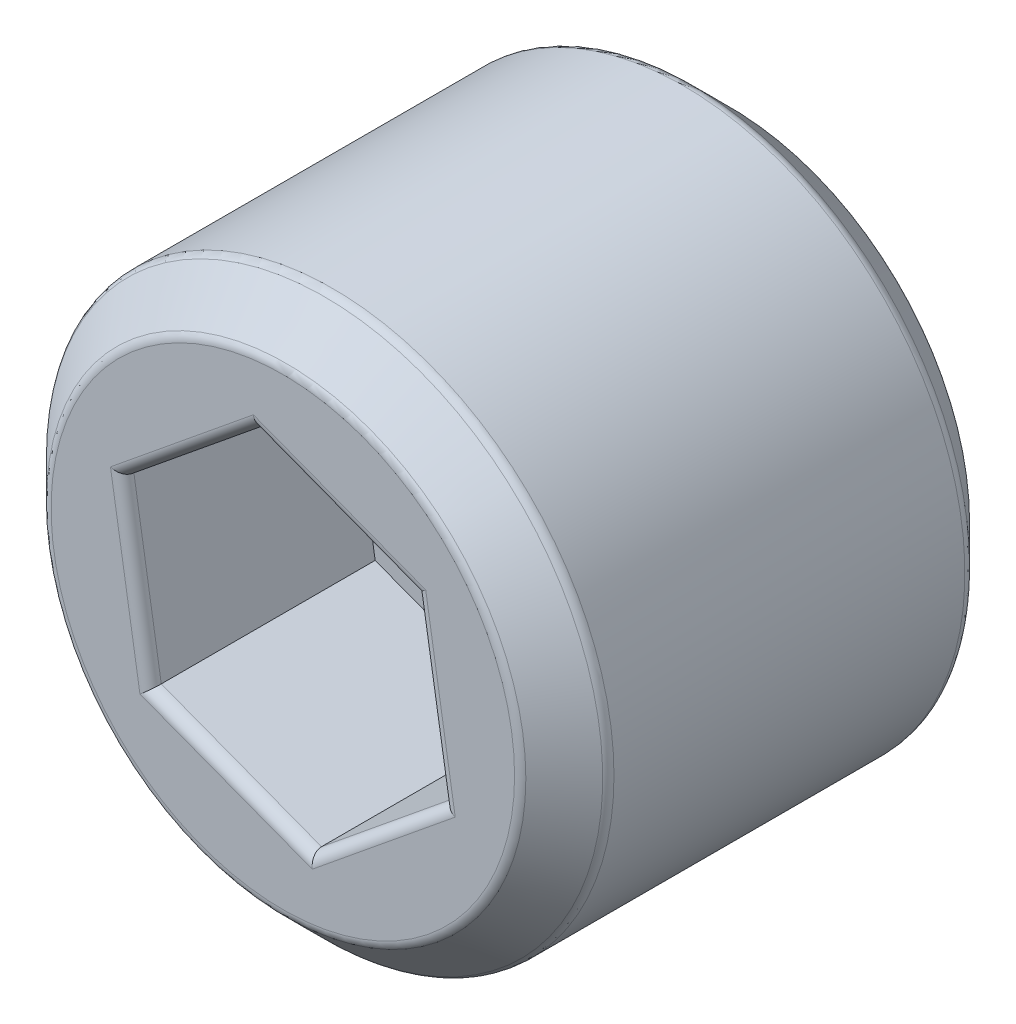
from build123d import *

# Parameters (mm, degrees)
ESQUISSE1_R             = 2.5
EXTRUSION1_DEPTH        = 4
CHANFREIN1_SIZE         = 0.4
ENL_V_MAT_EXTRU_1_DEPTH = 2
CONG_1_R                = 0.1


with BuildPart() as part:
    # Esquisse1 → Extrusion1 (new body)
    with BuildSketch(Plane.XY):
        with Locations(Location((0, 0, 0), (0, 0, 180))):
            Circle(ESQUISSE1_R)
    extrude(amount=EXTRUSION1_DEPTH)

    # Chanfrein1
    chanfrein1_edges = [part.edges().sort_by_distance(p)[0] for p in [
        (2.5, 0, 0),
        (2.5, 0, 4),
    ]]
    chamfer(chanfrein1_edges, length=CHANFREIN1_SIZE)

    # Esquisse2 → Enl_v. mat.-Extru.1 (cut)
    with BuildSketch(Plane.XY.offset(4)):
        Polygon((-0.243424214, 1.502899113), (-1.423260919, 0.540638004), (-1.179836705, -0.96226111), (0.243424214, -1.502899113), (1.423260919, -0.540638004), (1.179836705, 0.96226111), align=None)
    extrude(amount=-ENL_V_MAT_EXTRU_1_DEPTH, mode=Mode.SUBTRACT)

    # Cong_1
    cong_1_edges = [part.edges().sort_by_distance(p)[0] for p in [
        (2.5, 0, 0.4),
        (2.5, 0, 3.6),
        (2.1, 0, 0),
        (2.1, 0, 4),
        (-0.833342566, 1.021768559, 4),
        (-1.301548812, -0.210811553, 4),
        (-0.468206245, -1.232580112, 4),
        (0.833342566, -1.021768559, 4),
        (1.301548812, 0.210811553, 4),
        (0.468206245, 1.232580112, 4),
    ]]
    fillet(cong_1_edges, radius=CONG_1_R)


solid = part.part
